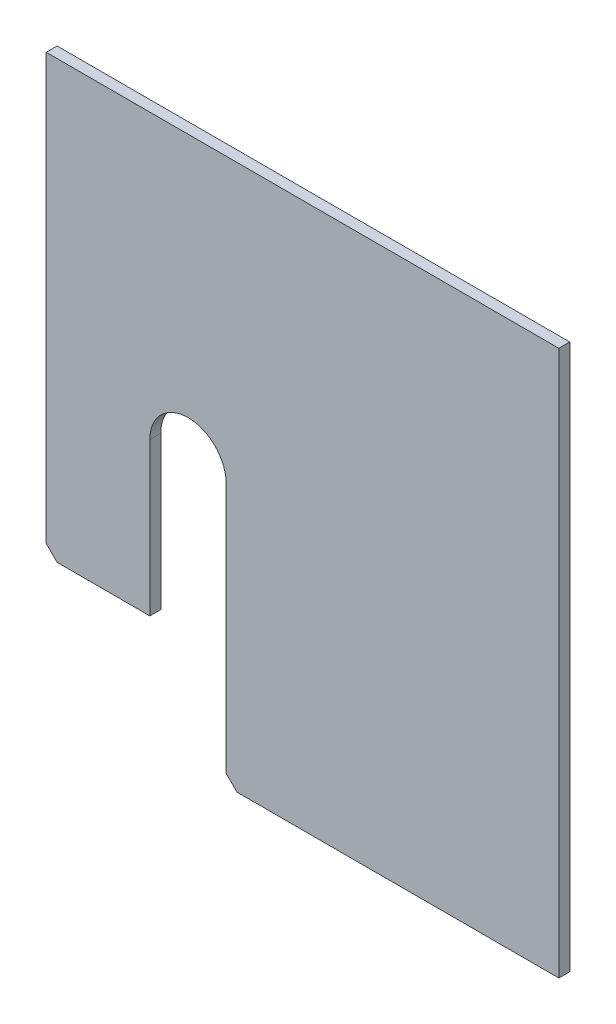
from build123d import *

# Parameters (mm, degrees)
BOSS_EXTRU_1_DEPTH = 10


with BuildPart() as part:
    # Esquisse1 → Boss.-Extru.1 (new body)
    with BuildSketch(Plane.XY):
        with BuildLine():
            Line((10, 100), (95, 100))
            Line((95, 100), (95, 240))
            ThreePointArc((95, 240), (130, 275), (165, 240))
            Line((165, 240), (165, 10))
            Line((165, 10), (175, 0))
            Line((175, 0), (470, 0))
            Line((470, 0), (470, 500))
            Line((470, 500), (0, 500))
            Line((0, 500), (0, 110))
            Line((0, 110), (10, 100))
        make_face()
    extrude(amount=BOSS_EXTRU_1_DEPTH)


solid = part.part
